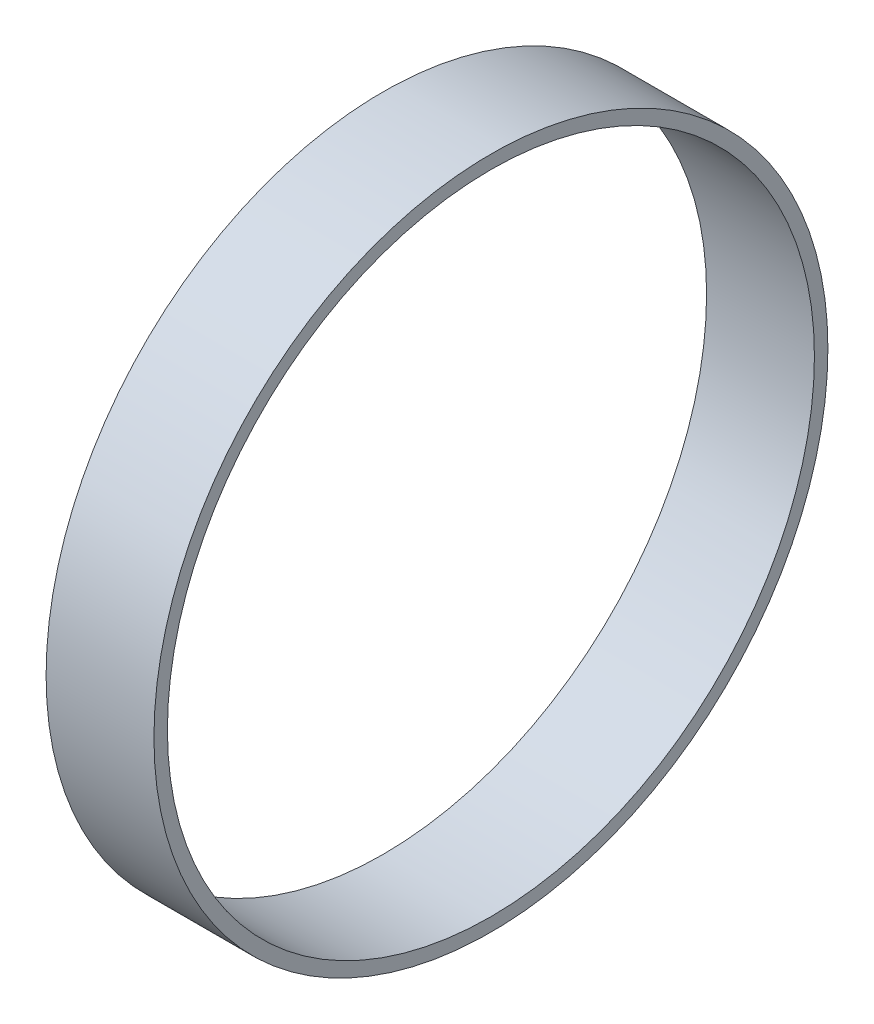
ISO-10303-21;
HEADER;
FILE_DESCRIPTION(('STEP AP214'),'2;1');
FILE_NAME('part.step','',(''),(''),'','','');
FILE_SCHEMA(('AUTOMOTIVE_DESIGN { 1 0 10303 214 1 1 1 1 }'));
ENDSEC;
DATA;
#1=APPLICATION_CONTEXT('core data for automotive mechanical design processes');
#2=APPLICATION_PROTOCOL_DEFINITION('international standard','automotive_design',2000,#1);
#3=PRODUCT_CONTEXT('',#1,'mechanical');
#4=PRODUCT('Part','Part','',(#3));
#5=PRODUCT_RELATED_PRODUCT_CATEGORY('part','',(#4));
#6=PRODUCT_DEFINITION_FORMATION('','',#4);
#7=PRODUCT_DEFINITION_CONTEXT('part definition',#1,'design');
#8=PRODUCT_DEFINITION('design','',#6,#7);
#9=PRODUCT_DEFINITION_SHAPE('','',#8);
#10=(LENGTH_UNIT() NAMED_UNIT(*) SI_UNIT(.MILLI.,.METRE.));
#11=(NAMED_UNIT(*) PLANE_ANGLE_UNIT() SI_UNIT($,.RADIAN.));
#12=(NAMED_UNIT(*) SI_UNIT($,.STERADIAN.) SOLID_ANGLE_UNIT());
#13=UNCERTAINTY_MEASURE_WITH_UNIT(LENGTH_MEASURE(1.E-05),#10,'distance_accuracy_value','');
#14=(GEOMETRIC_REPRESENTATION_CONTEXT(3) GLOBAL_UNCERTAINTY_ASSIGNED_CONTEXT((#13)) GLOBAL_UNIT_ASSIGNED_CONTEXT((#10,
#11,#12)) REPRESENTATION_CONTEXT('',''));
#15=CARTESIAN_POINT('',(0.,0.,0.));
#16=DIRECTION('',(0.,0.,1.));
#17=DIRECTION('',(1.,0.,0.));
#18=AXIS2_PLACEMENT_3D('',#15,#16,#17);
#19=CARTESIAN_POINT('',(8.,0.,0.));
#20=DIRECTION('',(1.,0.,0.));
#21=DIRECTION('',(0.,0.,-1.));
#22=AXIS2_PLACEMENT_3D('',#19,#20,#21);
#23=PLANE('',#22);
#24=CARTESIAN_POINT('',(8.,0.,0.));
#25=DIRECTION('',(1.,0.,0.));
#26=DIRECTION('',(0.,0.,-1.));
#27=AXIS2_PLACEMENT_3D('',#24,#25,#26);
#28=CIRCLE('',#27,25.);
#29=CARTESIAN_POINT('',(8.,0.,-25.));
#30=VERTEX_POINT('',#29);
#31=EDGE_CURVE('E10',#30,#30,#28,.T.);
#32=ORIENTED_EDGE('',*,*,#31,.T.);
#33=EDGE_LOOP('',(#32));
#34=FACE_BOUND('',#33,.T.);
#35=CARTESIAN_POINT('',(8.,0.,0.));
#36=DIRECTION('',(1.,0.,0.));
#37=DIRECTION('',(0.,0.,-1.));
#38=AXIS2_PLACEMENT_3D('',#35,#36,#37);
#39=CIRCLE('',#38,24.);
#40=CARTESIAN_POINT('',(8.,0.,-24.));
#41=VERTEX_POINT('',#40);
#42=EDGE_CURVE('E46',#41,#41,#39,.T.);
#43=ORIENTED_EDGE('',*,*,#42,.F.);
#44=EDGE_LOOP('',(#43));
#45=FACE_BOUND('',#44,.T.);
#46=ADVANCED_FACE('F35',(#34,#45),#23,.T.);
#47=CARTESIAN_POINT('',(0.,0.,0.));
#48=DIRECTION('',(1.,0.,0.));
#49=DIRECTION('',(0.,0.,-1.));
#50=AXIS2_PLACEMENT_3D('',#47,#48,#49);
#51=PLANE('',#50);
#52=CARTESIAN_POINT('',(0.,0.,0.));
#53=DIRECTION('',(1.,0.,0.));
#54=DIRECTION('',(0.,0.,-1.));
#55=AXIS2_PLACEMENT_3D('',#52,#53,#54);
#56=CIRCLE('',#55,25.);
#57=CARTESIAN_POINT('',(0.,0.,-25.));
#58=VERTEX_POINT('',#57);
#59=EDGE_CURVE('E42',#58,#58,#56,.T.);
#60=ORIENTED_EDGE('',*,*,#59,.F.);
#61=EDGE_LOOP('',(#60));
#62=FACE_BOUND('',#61,.T.);
#63=CARTESIAN_POINT('',(0.,0.,0.));
#64=DIRECTION('',(1.,0.,0.));
#65=DIRECTION('',(0.,0.,-1.));
#66=AXIS2_PLACEMENT_3D('',#63,#64,#65);
#67=CIRCLE('',#66,24.);
#68=CARTESIAN_POINT('',(0.,0.,-24.));
#69=VERTEX_POINT('',#68);
#70=EDGE_CURVE('E50',#69,#69,#67,.T.);
#71=ORIENTED_EDGE('',*,*,#70,.T.);
#72=EDGE_LOOP('',(#71));
#73=FACE_BOUND('',#72,.T.);
#74=ADVANCED_FACE('F56',(#62,#73),#51,.F.);
#75=CARTESIAN_POINT('',(8.,0.,0.));
#76=DIRECTION('',(-1.,0.,0.));
#77=DIRECTION('',(0.,0.,1.));
#78=AXIS2_PLACEMENT_3D('',#75,#76,#77);
#79=CYLINDRICAL_SURFACE('',#78,25.);
#80=ORIENTED_EDGE('',*,*,#31,.F.);
#81=EDGE_LOOP('',(#80));
#82=FACE_BOUND('',#81,.T.);
#83=ORIENTED_EDGE('',*,*,#59,.T.);
#84=EDGE_LOOP('',(#83));
#85=FACE_BOUND('',#84,.T.);
#86=ADVANCED_FACE('F37',(#82,#85),#79,.T.);
#87=CARTESIAN_POINT('',(8.,0.,0.));
#88=DIRECTION('',(-1.,0.,0.));
#89=DIRECTION('',(0.,0.,1.));
#90=AXIS2_PLACEMENT_3D('',#87,#88,#89);
#91=CYLINDRICAL_SURFACE('',#90,24.);
#92=ORIENTED_EDGE('',*,*,#42,.T.);
#93=EDGE_LOOP('',(#92));
#94=FACE_BOUND('',#93,.T.);
#95=ORIENTED_EDGE('',*,*,#70,.F.);
#96=EDGE_LOOP('',(#95));
#97=FACE_BOUND('',#96,.T.);
#98=ADVANCED_FACE('F58',(#94,#97),#91,.F.);
#99=CLOSED_SHELL('',(#46,#74,#86,#98));
#100=MANIFOLD_SOLID_BREP('B2',#99);
#101=ADVANCED_BREP_SHAPE_REPRESENTATION('',(#18,#100),#14);
#102=SHAPE_DEFINITION_REPRESENTATION(#9,#101);
ENDSEC;
END-ISO-10303-21;
